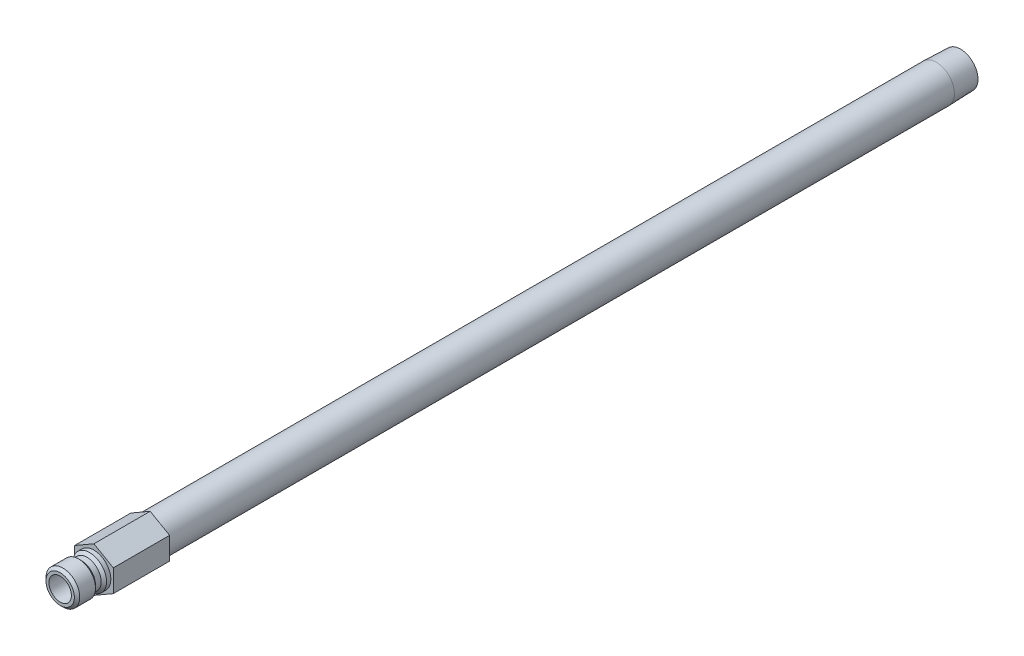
ISO-10303-21;
HEADER;
FILE_DESCRIPTION(('STEP AP214'),'2;1');
FILE_NAME('part.step','',(''),(''),'','','');
FILE_SCHEMA(('AUTOMOTIVE_DESIGN { 1 0 10303 214 1 1 1 1 }'));
ENDSEC;
DATA;
#1=APPLICATION_CONTEXT('core data for automotive mechanical design processes');
#2=APPLICATION_PROTOCOL_DEFINITION('international standard','automotive_design',2000,#1);
#3=PRODUCT_CONTEXT('',#1,'mechanical');
#4=PRODUCT('Part','Part','',(#3));
#5=PRODUCT_RELATED_PRODUCT_CATEGORY('part','',(#4));
#6=PRODUCT_DEFINITION_FORMATION('','',#4);
#7=PRODUCT_DEFINITION_CONTEXT('part definition',#1,'design');
#8=PRODUCT_DEFINITION('design','',#6,#7);
#9=PRODUCT_DEFINITION_SHAPE('','',#8);
#10=(LENGTH_UNIT() NAMED_UNIT(*) SI_UNIT(.MILLI.,.METRE.));
#11=(NAMED_UNIT(*) PLANE_ANGLE_UNIT() SI_UNIT($,.RADIAN.));
#12=(NAMED_UNIT(*) SI_UNIT($,.STERADIAN.) SOLID_ANGLE_UNIT());
#13=UNCERTAINTY_MEASURE_WITH_UNIT(LENGTH_MEASURE(1.E-05),#10,'distance_accuracy_value','');
#14=(GEOMETRIC_REPRESENTATION_CONTEXT(3) GLOBAL_UNCERTAINTY_ASSIGNED_CONTEXT((#13)) GLOBAL_UNIT_ASSIGNED_CONTEXT((#10,
#11,#12)) REPRESENTATION_CONTEXT('',''));
#15=CARTESIAN_POINT('',(0.,0.,0.));
#16=DIRECTION('',(0.,0.,1.));
#17=DIRECTION('',(1.,0.,0.));
#18=AXIS2_PLACEMENT_3D('',#15,#16,#17);
#19=CARTESIAN_POINT('',(0.,4.7625,0.));
#20=DIRECTION('',(0.,0.,1.));
#21=DIRECTION('',(0.,-1.,0.));
#22=AXIS2_PLACEMENT_3D('',#19,#20,#21);
#23=PLANE('',#22);
#24=CARTESIAN_POINT('',(0.,0.,0.));
#25=DIRECTION('',(0.,0.,-1.));
#26=DIRECTION('',(0.,1.,0.));
#27=AXIS2_PLACEMENT_3D('',#24,#25,#26);
#28=CIRCLE('',#27,4.7625);
#29=CARTESIAN_POINT('',(0.,4.7625,0.));
#30=VERTEX_POINT('',#29);
#31=EDGE_CURVE('E166',#30,#30,#28,.T.);
#32=ORIENTED_EDGE('',*,*,#31,.T.);
#33=EDGE_LOOP('',(#32));
#34=FACE_BOUND('',#33,.T.);
#35=DIRECTION('',(-0.866025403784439,-0.5,0.));
#36=VECTOR('',#35,1.);
#37=CARTESIAN_POINT('',(0.,6.3058196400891,0.));
#38=LINE('',#37,#36);
#39=CARTESIAN_POINT('',(0.,6.3058196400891,0.));
#40=VERTEX_POINT('',#39);
#41=CARTESIAN_POINT('',(-5.461,3.15290982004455,0.));
#42=VERTEX_POINT('',#41);
#43=EDGE_CURVE('E122',#40,#42,#38,.T.);
#44=ORIENTED_EDGE('',*,*,#43,.T.);
#45=DIRECTION('',(0.,-1.,0.));
#46=VECTOR('',#45,1.);
#47=CARTESIAN_POINT('',(-5.461,3.15290982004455,0.));
#48=LINE('',#47,#46);
#49=CARTESIAN_POINT('',(-5.461,-3.15290982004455,0.));
#50=VERTEX_POINT('',#49);
#51=EDGE_CURVE('E125',#42,#50,#48,.T.);
#52=ORIENTED_EDGE('',*,*,#51,.T.);
#53=DIRECTION('',(0.866025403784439,-0.5,0.));
#54=VECTOR('',#53,1.);
#55=CARTESIAN_POINT('',(-5.461,-3.15290982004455,0.));
#56=LINE('',#55,#54);
#57=CARTESIAN_POINT('',(0.,-6.30581964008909,0.));
#58=VERTEX_POINT('',#57);
#59=EDGE_CURVE('E129',#50,#58,#56,.T.);
#60=ORIENTED_EDGE('',*,*,#59,.T.);
#61=DIRECTION('',(0.866025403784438,0.5,0.));
#62=VECTOR('',#61,1.);
#63=CARTESIAN_POINT('',(0.,-6.30581964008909,0.));
#64=LINE('',#63,#62);
#65=CARTESIAN_POINT('',(5.461,-3.15290982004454,0.));
#66=VERTEX_POINT('',#65);
#67=EDGE_CURVE('E132',#58,#66,#64,.T.);
#68=ORIENTED_EDGE('',*,*,#67,.T.);
#69=DIRECTION('',(0.,1.,0.));
#70=VECTOR('',#69,1.);
#71=CARTESIAN_POINT('',(5.461,-3.15290982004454,0.));
#72=LINE('',#71,#70);
#73=CARTESIAN_POINT('',(5.461,3.15290982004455,0.));
#74=VERTEX_POINT('',#73);
#75=EDGE_CURVE('E99',#66,#74,#72,.T.);
#76=ORIENTED_EDGE('',*,*,#75,.T.);
#77=DIRECTION('',(-0.866025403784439,0.5,0.));
#78=VECTOR('',#77,1.);
#79=CARTESIAN_POINT('',(5.461,3.15290982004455,0.));
#80=LINE('',#79,#78);
#81=EDGE_CURVE('E135',#74,#40,#80,.T.);
#82=ORIENTED_EDGE('',*,*,#81,.T.);
#83=EDGE_LOOP('',(#44,#52,#60,#68,#76,#82));
#84=FACE_BOUND('',#83,.T.);
#85=ADVANCED_FACE('F33',(#34,#84),#23,.T.);
#86=CARTESIAN_POINT('',(0.,0.,0.));
#87=DIRECTION('',(0.,0.,-1.));
#88=DIRECTION('',(0.,1.,0.));
#89=AXIS2_PLACEMENT_3D('',#86,#87,#88);
#90=CYLINDRICAL_SURFACE('',#89,4.7625);
#91=CARTESIAN_POINT('',(0.,0.,1.2065));
#92=DIRECTION('',(0.,0.,-1.));
#93=DIRECTION('',(0.,1.,0.));
#94=AXIS2_PLACEMENT_3D('',#91,#92,#93);
#95=CIRCLE('',#94,4.7625);
#96=CARTESIAN_POINT('',(0.,4.7625,1.2065));
#97=VERTEX_POINT('',#96);
#98=EDGE_CURVE('E163',#97,#97,#95,.T.);
#99=ORIENTED_EDGE('',*,*,#98,.T.);
#100=EDGE_LOOP('',(#99));
#101=FACE_BOUND('',#100,.T.);
#102=ORIENTED_EDGE('',*,*,#31,.F.);
#103=EDGE_LOOP('',(#102));
#104=FACE_BOUND('',#103,.T.);
#105=ADVANCED_FACE('F192',(#101,#104),#90,.T.);
#106=CARTESIAN_POINT('',(0.,0.,1.2065));
#107=DIRECTION('',(0.,0.,-1.));
#108=DIRECTION('',(0.,1.,0.));
#109=AXIS2_PLACEMENT_3D('',#106,#107,#108);
#110=CONICAL_SURFACE('',#109,4.7625,0.785398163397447);
#111=CARTESIAN_POINT('',(0.,0.,1.9685));
#112=DIRECTION('',(0.,0.,-1.));
#113=DIRECTION('',(0.,1.,0.));
#114=AXIS2_PLACEMENT_3D('',#111,#112,#113);
#115=CIRCLE('',#114,4.0005);
#116=CARTESIAN_POINT('',(0.,4.0005,1.9685));
#117=VERTEX_POINT('',#116);
#118=EDGE_CURVE('E160',#117,#117,#115,.T.);
#119=ORIENTED_EDGE('',*,*,#118,.T.);
#120=EDGE_LOOP('',(#119));
#121=FACE_BOUND('',#120,.T.);
#122=ORIENTED_EDGE('',*,*,#98,.F.);
#123=EDGE_LOOP('',(#122));
#124=FACE_BOUND('',#123,.T.);
#125=ADVANCED_FACE('F198',(#121,#124),#110,.T.);
#126=CARTESIAN_POINT('',(0.,0.,0.));
#127=DIRECTION('',(0.,0.,-1.));
#128=DIRECTION('',(0.,1.,0.));
#129=AXIS2_PLACEMENT_3D('',#126,#127,#128);
#130=CYLINDRICAL_SURFACE('',#129,4.0005);
#131=CARTESIAN_POINT('',(0.,0.,3.556));
#132=DIRECTION('',(0.,0.,-1.));
#133=DIRECTION('',(0.,1.,0.));
#134=AXIS2_PLACEMENT_3D('',#131,#132,#133);
#135=CIRCLE('',#134,4.0005);
#136=CARTESIAN_POINT('',(0.,4.0005,3.556));
#137=VERTEX_POINT('',#136);
#138=EDGE_CURVE('E157',#137,#137,#135,.T.);
#139=ORIENTED_EDGE('',*,*,#138,.T.);
#140=EDGE_LOOP('',(#139));
#141=FACE_BOUND('',#140,.T.);
#142=ORIENTED_EDGE('',*,*,#118,.F.);
#143=EDGE_LOOP('',(#142));
#144=FACE_BOUND('',#143,.T.);
#145=ADVANCED_FACE('F258',(#141,#144),#130,.T.);
#146=CARTESIAN_POINT('',(0.,0.,3.556));
#147=DIRECTION('',(0.,0.,1.));
#148=DIRECTION('',(0.,-1.,0.));
#149=AXIS2_PLACEMENT_3D('',#146,#147,#148);
#150=CONICAL_SURFACE('',#149,4.0005,0.785398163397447);
#151=CARTESIAN_POINT('',(0.,0.,4.318));
#152=DIRECTION('',(0.,0.,-1.));
#153=DIRECTION('',(0.,1.,0.));
#154=AXIS2_PLACEMENT_3D('',#151,#152,#153);
#155=CIRCLE('',#154,4.7625);
#156=CARTESIAN_POINT('',(0.,4.7625,4.318));
#157=VERTEX_POINT('',#156);
#158=EDGE_CURVE('E154',#157,#157,#155,.T.);
#159=ORIENTED_EDGE('',*,*,#158,.T.);
#160=EDGE_LOOP('',(#159));
#161=FACE_BOUND('',#160,.T.);
#162=ORIENTED_EDGE('',*,*,#138,.F.);
#163=EDGE_LOOP('',(#162));
#164=FACE_BOUND('',#163,.T.);
#165=ADVANCED_FACE('F254',(#161,#164),#150,.T.);
#166=CARTESIAN_POINT('',(0.,0.,0.));
#167=DIRECTION('',(0.,0.,-1.));
#168=DIRECTION('',(0.,1.,0.));
#169=AXIS2_PLACEMENT_3D('',#166,#167,#168);
#170=CYLINDRICAL_SURFACE('',#169,4.7625);
#171=CARTESIAN_POINT('',(0.,0.,8.763));
#172=DIRECTION('',(0.,0.,-1.));
#173=DIRECTION('',(0.,1.,0.));
#174=AXIS2_PLACEMENT_3D('',#171,#172,#173);
#175=CIRCLE('',#174,4.7625);
#176=CARTESIAN_POINT('',(0.,4.7625,8.763));
#177=VERTEX_POINT('',#176);
#178=EDGE_CURVE('E151',#177,#177,#175,.T.);
#179=ORIENTED_EDGE('',*,*,#178,.T.);
#180=EDGE_LOOP('',(#179));
#181=FACE_BOUND('',#180,.T.);
#182=ORIENTED_EDGE('',*,*,#158,.F.);
#183=EDGE_LOOP('',(#182));
#184=FACE_BOUND('',#183,.T.);
#185=ADVANCED_FACE('F250',(#181,#184),#170,.T.);
#186=CARTESIAN_POINT('',(0.,0.,8.763));
#187=DIRECTION('',(0.,0.,-1.));
#188=DIRECTION('',(0.,1.,0.));
#189=AXIS2_PLACEMENT_3D('',#186,#187,#188);
#190=CONICAL_SURFACE('',#189,4.7625,0.785398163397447);
#191=CARTESIAN_POINT('',(0.,0.,9.525));
#192=DIRECTION('',(0.,0.,-1.));
#193=DIRECTION('',(0.,1.,0.));
#194=AXIS2_PLACEMENT_3D('',#191,#192,#193);
#195=CIRCLE('',#194,4.0005);
#196=CARTESIAN_POINT('',(0.,4.0005,9.525));
#197=VERTEX_POINT('',#196);
#198=EDGE_CURVE('E148',#197,#197,#195,.T.);
#199=ORIENTED_EDGE('',*,*,#198,.T.);
#200=EDGE_LOOP('',(#199));
#201=FACE_BOUND('',#200,.T.);
#202=ORIENTED_EDGE('',*,*,#178,.F.);
#203=EDGE_LOOP('',(#202));
#204=FACE_BOUND('',#203,.T.);
#205=ADVANCED_FACE('F246',(#201,#204),#190,.T.);
#206=CARTESIAN_POINT('',(0.,3.175,9.525));
#207=DIRECTION('',(0.,0.,1.));
#208=DIRECTION('',(0.,-1.,0.));
#209=AXIS2_PLACEMENT_3D('',#206,#207,#208);
#210=PLANE('',#209);
#211=CARTESIAN_POINT('',(0.,0.,9.525));
#212=DIRECTION('',(0.,0.,-1.));
#213=DIRECTION('',(0.,1.,0.));
#214=AXIS2_PLACEMENT_3D('',#211,#212,#213);
#215=CIRCLE('',#214,3.175);
#216=CARTESIAN_POINT('',(0.,3.175,9.525));
#217=VERTEX_POINT('',#216);
#218=EDGE_CURVE('E145',#217,#217,#215,.T.);
#219=ORIENTED_EDGE('',*,*,#218,.T.);
#220=EDGE_LOOP('',(#219));
#221=FACE_BOUND('',#220,.T.);
#222=ORIENTED_EDGE('',*,*,#198,.F.);
#223=EDGE_LOOP('',(#222));
#224=FACE_BOUND('',#223,.T.);
#225=ADVANCED_FACE('F242',(#221,#224),#210,.T.);
#226=CARTESIAN_POINT('',(0.,0.,0.));
#227=DIRECTION('',(0.,0.,-1.));
#228=DIRECTION('',(0.,1.,0.));
#229=AXIS2_PLACEMENT_3D('',#226,#227,#228);
#230=CYLINDRICAL_SURFACE('',#229,3.175);
#231=CARTESIAN_POINT('',(0.,0.,0.));
#232=DIRECTION('',(0.,0.,1.));
#233=DIRECTION('',(1.,0.,0.));
#234=AXIS2_PLACEMENT_3D('',#231,#232,#233);
#235=CIRCLE('',#234,3.175);
#236=CARTESIAN_POINT('',(3.175,0.,0.));
#237=VERTEX_POINT('',#236);
#238=EDGE_CURVE('E11',#237,#237,#235,.T.);
#239=ORIENTED_EDGE('',*,*,#238,.F.);
#240=EDGE_LOOP('',(#239));
#241=FACE_BOUND('',#240,.T.);
#242=ORIENTED_EDGE('',*,*,#218,.F.);
#243=EDGE_LOOP('',(#242));
#244=FACE_BOUND('',#243,.T.);
#245=ADVANCED_FACE('F226',(#241,#244),#230,.F.);
#246=CARTESIAN_POINT('',(-5.461,3.15290982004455,0.));
#247=DIRECTION('',(0.,0.,1.));
#248=DIRECTION('',(1.,0.,0.));
#249=AXIS2_PLACEMENT_3D('',#246,#247,#248);
#250=PLANE('',#249);
#251=ORIENTED_EDGE('',*,*,#238,.T.);
#252=EDGE_LOOP('',(#251));
#253=FACE_BOUND('',#252,.T.);
#254=CARTESIAN_POINT('',(0.,0.,0.));
#255=DIRECTION('',(0.,0.,1.));
#256=DIRECTION('',(1.,0.,0.));
#257=AXIS2_PLACEMENT_3D('',#254,#255,#256);
#258=CIRCLE('',#257,2.38124999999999);
#259=CARTESIAN_POINT('',(2.38124999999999,0.,0.));
#260=VERTEX_POINT('',#259);
#261=EDGE_CURVE('E126',#260,#260,#258,.T.);
#262=ORIENTED_EDGE('',*,*,#261,.F.);
#263=EDGE_LOOP('',(#262));
#264=FACE_BOUND('',#263,.T.);
#265=ADVANCED_FACE('F222',(#253,#264),#250,.T.);
#266=CARTESIAN_POINT('',(0.,6.3058196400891,-15.875));
#267=DIRECTION('',(-0.5,0.866025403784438,0.));
#268=DIRECTION('',(-0.866025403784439,-0.5,0.));
#269=AXIS2_PLACEMENT_3D('',#266,#267,#268);
#270=PLANE('',#269);
#271=ORIENTED_EDGE('',*,*,#43,.F.);
#272=DIRECTION('',(0.,0.,1.));
#273=VECTOR('',#272,1.);
#274=CARTESIAN_POINT('',(0.,6.3058196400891,-15.875));
#275=LINE('',#274,#273);
#276=CARTESIAN_POINT('',(0.,6.3058196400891,-15.875));
#277=VERTEX_POINT('',#276);
#278=EDGE_CURVE('E51',#277,#40,#275,.T.);
#279=ORIENTED_EDGE('',*,*,#278,.F.);
#280=DIRECTION('',(-0.866025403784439,-0.5,0.));
#281=VECTOR('',#280,1.);
#282=CARTESIAN_POINT('',(0.,6.3058196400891,-15.875));
#283=LINE('',#282,#281);
#284=CARTESIAN_POINT('',(-5.461,3.15290982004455,-15.875));
#285=VERTEX_POINT('',#284);
#286=EDGE_CURVE('E138',#277,#285,#283,.T.);
#287=ORIENTED_EDGE('',*,*,#286,.T.);
#288=DIRECTION('',(0.,0.,1.));
#289=VECTOR('',#288,1.);
#290=CARTESIAN_POINT('',(-5.461,3.15290982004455,-15.875));
#291=LINE('',#290,#289);
#292=EDGE_CURVE('E86',#285,#42,#291,.T.);
#293=ORIENTED_EDGE('',*,*,#292,.T.);
#294=EDGE_LOOP('',(#271,#279,#287,#293));
#295=FACE_BOUND('',#294,.T.);
#296=ADVANCED_FACE('F225',(#295),#270,.T.);
#297=CARTESIAN_POINT('',(5.461,3.15290982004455,-15.875));
#298=DIRECTION('',(0.5,0.866025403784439,0.));
#299=DIRECTION('',(-0.866025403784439,0.5,0.));
#300=AXIS2_PLACEMENT_3D('',#297,#298,#299);
#301=PLANE('',#300);
#302=ORIENTED_EDGE('',*,*,#81,.F.);
#303=DIRECTION('',(0.,0.,1.));
#304=VECTOR('',#303,1.);
#305=CARTESIAN_POINT('',(5.461,3.15290982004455,-15.875));
#306=LINE('',#305,#304);
#307=CARTESIAN_POINT('',(5.461,3.15290982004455,-15.875));
#308=VERTEX_POINT('',#307);
#309=EDGE_CURVE('E74',#308,#74,#306,.T.);
#310=ORIENTED_EDGE('',*,*,#309,.F.);
#311=DIRECTION('',(-0.866025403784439,0.5,0.));
#312=VECTOR('',#311,1.);
#313=CARTESIAN_POINT('',(5.461,3.15290982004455,-15.875));
#314=LINE('',#313,#312);
#315=EDGE_CURVE('E112',#308,#277,#314,.T.);
#316=ORIENTED_EDGE('',*,*,#315,.T.);
#317=ORIENTED_EDGE('',*,*,#278,.T.);
#318=EDGE_LOOP('',(#302,#310,#316,#317));
#319=FACE_BOUND('',#318,.T.);
#320=ADVANCED_FACE('F228',(#319),#301,.T.);
#321=CARTESIAN_POINT('',(5.461,-3.15290982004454,-15.875));
#322=DIRECTION('',(1.,0.,0.));
#323=DIRECTION('',(0.,1.,0.));
#324=AXIS2_PLACEMENT_3D('',#321,#322,#323);
#325=PLANE('',#324);
#326=ORIENTED_EDGE('',*,*,#75,.F.);
#327=DIRECTION('',(0.,0.,1.));
#328=VECTOR('',#327,1.);
#329=CARTESIAN_POINT('',(5.461,-3.15290982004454,-15.875));
#330=LINE('',#329,#328);
#331=CARTESIAN_POINT('',(5.461,-3.15290982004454,-15.875));
#332=VERTEX_POINT('',#331);
#333=EDGE_CURVE('E94',#332,#66,#330,.T.);
#334=ORIENTED_EDGE('',*,*,#333,.F.);
#335=DIRECTION('',(0.,1.,0.));
#336=VECTOR('',#335,1.);
#337=CARTESIAN_POINT('',(5.461,-3.15290982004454,-15.875));
#338=LINE('',#337,#336);
#339=EDGE_CURVE('E97',#332,#308,#338,.T.);
#340=ORIENTED_EDGE('',*,*,#339,.T.);
#341=ORIENTED_EDGE('',*,*,#309,.T.);
#342=EDGE_LOOP('',(#326,#334,#340,#341));
#343=FACE_BOUND('',#342,.T.);
#344=ADVANCED_FACE('F96',(#343),#325,.T.);
#345=CARTESIAN_POINT('',(0.,-6.30581964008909,-15.875));
#346=DIRECTION('',(0.5,-0.866025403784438,0.));
#347=DIRECTION('',(0.866025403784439,0.5,0.));
#348=AXIS2_PLACEMENT_3D('',#345,#346,#347);
#349=PLANE('',#348);
#350=ORIENTED_EDGE('',*,*,#67,.F.);
#351=DIRECTION('',(0.,0.,1.));
#352=VECTOR('',#351,1.);
#353=CARTESIAN_POINT('',(0.,-6.30581964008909,-15.875));
#354=LINE('',#353,#352);
#355=CARTESIAN_POINT('',(0.,-6.30581964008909,-15.875));
#356=VERTEX_POINT('',#355);
#357=EDGE_CURVE('E104',#356,#58,#354,.T.);
#358=ORIENTED_EDGE('',*,*,#357,.F.);
#359=DIRECTION('',(0.866025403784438,0.5,0.));
#360=VECTOR('',#359,1.);
#361=CARTESIAN_POINT('',(0.,-6.30581964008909,-15.875));
#362=LINE('',#361,#360);
#363=EDGE_CURVE('E110',#356,#332,#362,.T.);
#364=ORIENTED_EDGE('',*,*,#363,.T.);
#365=ORIENTED_EDGE('',*,*,#333,.T.);
#366=EDGE_LOOP('',(#350,#358,#364,#365));
#367=FACE_BOUND('',#366,.T.);
#368=ADVANCED_FACE('F114',(#367),#349,.T.);
#369=CARTESIAN_POINT('',(-5.461,-3.15290982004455,-15.875));
#370=DIRECTION('',(-0.5,-0.866025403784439,0.));
#371=DIRECTION('',(0.866025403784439,-0.5,0.));
#372=AXIS2_PLACEMENT_3D('',#369,#370,#371);
#373=PLANE('',#372);
#374=ORIENTED_EDGE('',*,*,#59,.F.);
#375=DIRECTION('',(0.,0.,1.));
#376=VECTOR('',#375,1.);
#377=CARTESIAN_POINT('',(-5.461,-3.15290982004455,-15.875));
#378=LINE('',#377,#376);
#379=CARTESIAN_POINT('',(-5.461,-3.15290982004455,-15.875));
#380=VERTEX_POINT('',#379);
#381=EDGE_CURVE('E142',#380,#50,#378,.T.);
#382=ORIENTED_EDGE('',*,*,#381,.F.);
#383=DIRECTION('',(0.866025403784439,-0.5,0.));
#384=VECTOR('',#383,1.);
#385=CARTESIAN_POINT('',(-5.461,-3.15290982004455,-15.875));
#386=LINE('',#385,#384);
#387=EDGE_CURVE('E115',#380,#356,#386,.T.);
#388=ORIENTED_EDGE('',*,*,#387,.T.);
#389=ORIENTED_EDGE('',*,*,#357,.T.);
#390=EDGE_LOOP('',(#374,#382,#388,#389));
#391=FACE_BOUND('',#390,.T.);
#392=ADVANCED_FACE('F219',(#391),#373,.T.);
#393=CARTESIAN_POINT('',(-5.461,3.15290982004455,-15.875));
#394=DIRECTION('',(-1.,0.,0.));
#395=DIRECTION('',(0.,0.,1.));
#396=AXIS2_PLACEMENT_3D('',#393,#394,#395);
#397=PLANE('',#396);
#398=ORIENTED_EDGE('',*,*,#51,.F.);
#399=ORIENTED_EDGE('',*,*,#292,.F.);
#400=DIRECTION('',(0.,-1.,0.));
#401=VECTOR('',#400,1.);
#402=CARTESIAN_POINT('',(-5.461,3.15290982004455,-15.875));
#403=LINE('',#402,#401);
#404=EDGE_CURVE('E117',#285,#380,#403,.T.);
#405=ORIENTED_EDGE('',*,*,#404,.T.);
#406=ORIENTED_EDGE('',*,*,#381,.T.);
#407=EDGE_LOOP('',(#398,#399,#405,#406));
#408=FACE_BOUND('',#407,.T.);
#409=ADVANCED_FACE('F214',(#408),#397,.T.);
#410=CARTESIAN_POINT('',(-5.461,3.15290982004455,-15.875));
#411=DIRECTION('',(0.,0.,1.));
#412=DIRECTION('',(1.,0.,0.));
#413=AXIS2_PLACEMENT_3D('',#410,#411,#412);
#414=PLANE('',#413);
#415=CARTESIAN_POINT('',(0.,0.,-15.875));
#416=DIRECTION('',(0.,0.,1.));
#417=DIRECTION('',(1.,0.,0.));
#418=AXIS2_PLACEMENT_3D('',#415,#416,#417);
#419=CIRCLE('',#418,5.14349999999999);
#420=CARTESIAN_POINT('',(5.14349999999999,0.,-15.875));
#421=VERTEX_POINT('',#420);
#422=EDGE_CURVE('E37',#421,#421,#419,.F.);
#423=ORIENTED_EDGE('',*,*,#422,.F.);
#424=EDGE_LOOP('',(#423));
#425=FACE_BOUND('',#424,.T.);
#426=ORIENTED_EDGE('',*,*,#286,.F.);
#427=ORIENTED_EDGE('',*,*,#315,.F.);
#428=ORIENTED_EDGE('',*,*,#339,.F.);
#429=ORIENTED_EDGE('',*,*,#363,.F.);
#430=ORIENTED_EDGE('',*,*,#387,.F.);
#431=ORIENTED_EDGE('',*,*,#404,.F.);
#432=EDGE_LOOP('',(#426,#427,#428,#429,#430,#431));
#433=FACE_BOUND('',#432,.T.);
#434=ADVANCED_FACE('F108',(#425,#433),#414,.F.);
#435=CARTESIAN_POINT('',(0.,0.,0.));
#436=DIRECTION('',(0.,0.,-1.));
#437=DIRECTION('',(0.,1.,0.));
#438=AXIS2_PLACEMENT_3D('',#435,#436,#437);
#439=CYLINDRICAL_SURFACE('',#438,2.38124999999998);
#440=CARTESIAN_POINT('',(0.,0.,-244.475));
#441=DIRECTION('',(0.,0.,-1.));
#442=DIRECTION('',(0.,1.,0.));
#443=AXIS2_PLACEMENT_3D('',#440,#441,#442);
#444=CIRCLE('',#443,2.38124999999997);
#445=CARTESIAN_POINT('',(0.,2.38125,-244.475));
#446=VERTEX_POINT('',#445);
#447=EDGE_CURVE('E43',#446,#446,#444,.T.);
#448=ORIENTED_EDGE('',*,*,#447,.T.);
#449=EDGE_LOOP('',(#448));
#450=FACE_BOUND('',#449,.T.);
#451=ORIENTED_EDGE('',*,*,#261,.T.);
#452=EDGE_LOOP('',(#451));
#453=FACE_BOUND('',#452,.T.);
#454=ADVANCED_FACE('F35',(#450,#453),#439,.F.);
#455=CARTESIAN_POINT('',(0.,4.9291887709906,-244.475));
#456=DIRECTION('',(0.,0.,-1.));
#457=DIRECTION('',(0.,1.,0.));
#458=AXIS2_PLACEMENT_3D('',#455,#456,#457);
#459=PLANE('',#458);
#460=CARTESIAN_POINT('',(0.,0.,-244.475));
#461=DIRECTION('',(0.,0.,-1.));
#462=DIRECTION('',(0.,1.,0.));
#463=AXIS2_PLACEMENT_3D('',#460,#461,#462);
#464=CIRCLE('',#463,4.92918877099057);
#465=CARTESIAN_POINT('',(0.,4.9291887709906,-244.475));
#466=VERTEX_POINT('',#465);
#467=EDGE_CURVE('E172',#466,#466,#464,.T.);
#468=ORIENTED_EDGE('',*,*,#467,.T.);
#469=EDGE_LOOP('',(#468));
#470=FACE_BOUND('',#469,.T.);
#471=ORIENTED_EDGE('',*,*,#447,.F.);
#472=EDGE_LOOP('',(#471));
#473=FACE_BOUND('',#472,.T.);
#474=ADVANCED_FACE('F180',(#470,#473),#459,.T.);
#475=CARTESIAN_POINT('',(0.,0.,-244.475));
#476=DIRECTION('',(0.,0.,1.));
#477=DIRECTION('',(0.,-1.,0.));
#478=AXIS2_PLACEMENT_3D('',#475,#476,#477);
#479=CONICAL_SURFACE('',#478,4.92918877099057,0.0312396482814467);
#480=CARTESIAN_POINT('',(0.,0.,-237.617));
#481=DIRECTION('',(0.,0.,-1.));
#482=DIRECTION('',(0.,1.,0.));
#483=AXIS2_PLACEMENT_3D('',#480,#481,#482);
#484=CIRCLE('',#483,5.14349999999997);
#485=CARTESIAN_POINT('',(0.,5.1435,-237.617));
#486=VERTEX_POINT('',#485);
#487=EDGE_CURVE('E169',#486,#486,#484,.T.);
#488=ORIENTED_EDGE('',*,*,#487,.T.);
#489=EDGE_LOOP('',(#488));
#490=FACE_BOUND('',#489,.T.);
#491=ORIENTED_EDGE('',*,*,#467,.F.);
#492=EDGE_LOOP('',(#491));
#493=FACE_BOUND('',#492,.T.);
#494=ADVANCED_FACE('F182',(#490,#493),#479,.T.);
#495=CARTESIAN_POINT('',(0.,0.,0.));
#496=DIRECTION('',(0.,0.,-1.));
#497=DIRECTION('',(0.,1.,0.));
#498=AXIS2_PLACEMENT_3D('',#495,#496,#497);
#499=CYLINDRICAL_SURFACE('',#498,5.14349999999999);
#500=ORIENTED_EDGE('',*,*,#487,.F.);
#501=EDGE_LOOP('',(#500));
#502=FACE_BOUND('',#501,.T.);
#503=ORIENTED_EDGE('',*,*,#422,.T.);
#504=EDGE_LOOP('',(#503));
#505=FACE_BOUND('',#504,.T.);
#506=ADVANCED_FACE('F188',(#502,#505),#499,.T.);
#507=CLOSED_SHELL('',(#85,#105,#125,#145,#165,#185,#205,#225,#245,#265,#296,#320,#344,#368,#392,
#409,#434,#454,#474,#494,#506));
#508=MANIFOLD_SOLID_BREP('B2',#507);
#509=ADVANCED_BREP_SHAPE_REPRESENTATION('',(#18,#508),#14);
#510=SHAPE_DEFINITION_REPRESENTATION(#9,#509);
ENDSEC;
END-ISO-10303-21;
